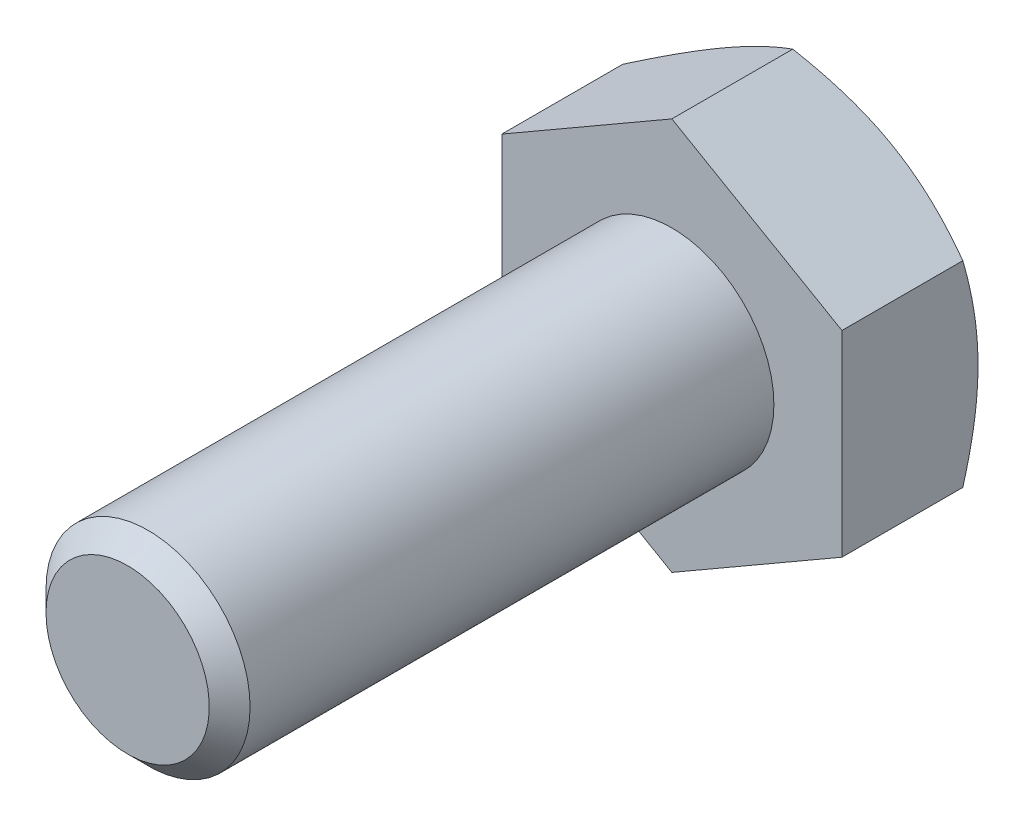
from build123d import *

# Parameters (mm, degrees)
ESQUISSE1_W        = 3
ESQUISSE1_H        = 16
CHANFREIN1_SIZE    = 0.6
BOSS_EXTRU_1_DEPTH = 4


with BuildPart() as part:
    # Esquisse1 → Base-R_volution (revolve)
    with BuildSketch(Plane(origin=(0, 0, 0), x_dir=(1, 0, 0), z_dir=(0, 1, 0))):
        with Locations((1.5, -8)):
            Rectangle(ESQUISSE1_W, ESQUISSE1_H)
    revolve(axis=Axis((0, 0, 0), (0, 0, 1)))

    # Chanfrein1
    chanfrein1_edges = [part.edges().sort_by_distance(p)[0] for p in [
        (-3, 0, 16),
    ]]
    chamfer(chanfrein1_edges, length=CHANFREIN1_SIZE)

    # Esquisse6 → Boss.-Extru.1 (add)
    with BuildSketch(Plane.XY):
        Polygon((5, -2.886751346), (5, 2.886751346), (0, 5.773502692), (-5, 2.886751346), (-5, -2.886751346), (0, -5.773502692), align=None)
    extrude(amount=-BOSS_EXTRU_1_DEPTH)

    # Esquisse7 → Enl_vement de mati_re-R_volution1 (revolve, cut)
    with BuildSketch(Plane(origin=(0, 0, 0), x_dir=(1, 0, 0), z_dir=(0, 1, 0))):
        Polygon((-5, 4), (-11.92820323, 4), (-11.92820323, 0), align=None)
    revolve(axis=Axis((0, 0, -6.239446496), (0, 0, 1)), mode=Mode.SUBTRACT)


solid = part.part
